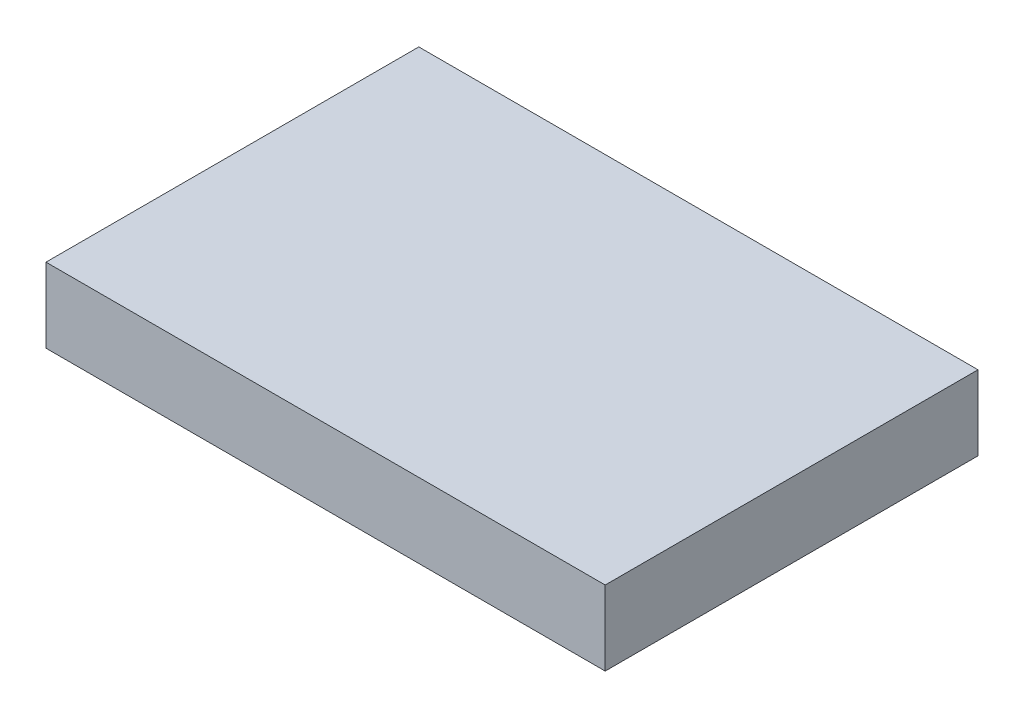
from build123d import *

# Parameters (mm, degrees)
CROQUIS1_W     = 150
CROQUIS1_H     = 100
EXTRUIR1_DEPTH = 20


with BuildPart() as part:
    # Croquis1 → Extruir1 (new body)
    with BuildSketch(Plane(origin=(0, 0, 0), x_dir=(1, 0, 0), z_dir=(0, 1, 0))):
        with Locations((12.018448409, -7.76025974)):
            Rectangle(CROQUIS1_W, CROQUIS1_H)
    extrude(amount=EXTRUIR1_DEPTH)


solid = part.part
